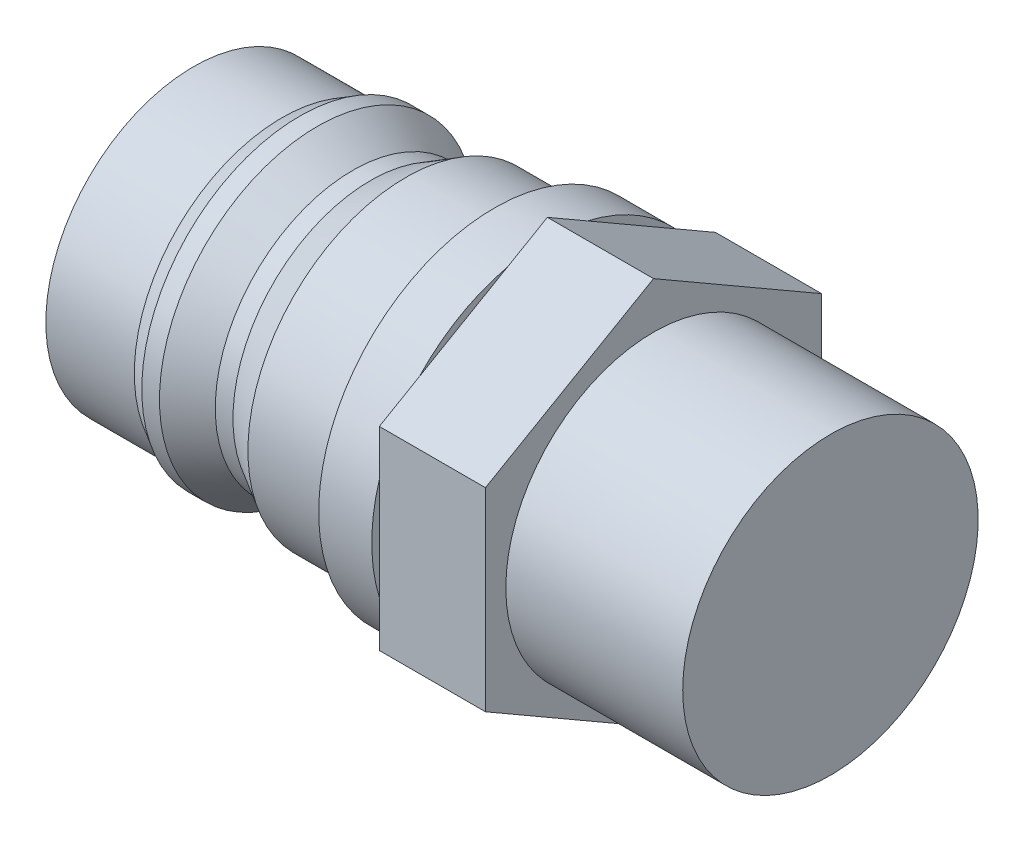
ISO-10303-21;
HEADER;
FILE_DESCRIPTION(('STEP AP214'),'2;1');
FILE_NAME('part.step','',(''),(''),'','','');
FILE_SCHEMA(('AUTOMOTIVE_DESIGN { 1 0 10303 214 1 1 1 1 }'));
ENDSEC;
DATA;
#1=APPLICATION_CONTEXT('core data for automotive mechanical design processes');
#2=APPLICATION_PROTOCOL_DEFINITION('international standard','automotive_design',2000,#1);
#3=PRODUCT_CONTEXT('',#1,'mechanical');
#4=PRODUCT('Part','Part','',(#3));
#5=PRODUCT_RELATED_PRODUCT_CATEGORY('part','',(#4));
#6=PRODUCT_DEFINITION_FORMATION('','',#4);
#7=PRODUCT_DEFINITION_CONTEXT('part definition',#1,'design');
#8=PRODUCT_DEFINITION('design','',#6,#7);
#9=PRODUCT_DEFINITION_SHAPE('','',#8);
#10=(LENGTH_UNIT() NAMED_UNIT(*) SI_UNIT(.MILLI.,.METRE.));
#11=(NAMED_UNIT(*) PLANE_ANGLE_UNIT() SI_UNIT($,.RADIAN.));
#12=(NAMED_UNIT(*) SI_UNIT($,.STERADIAN.) SOLID_ANGLE_UNIT());
#13=UNCERTAINTY_MEASURE_WITH_UNIT(LENGTH_MEASURE(1.E-05),#10,'distance_accuracy_value','');
#14=(GEOMETRIC_REPRESENTATION_CONTEXT(3) GLOBAL_UNCERTAINTY_ASSIGNED_CONTEXT((#13)) GLOBAL_UNIT_ASSIGNED_CONTEXT((#10,
#11,#12)) REPRESENTATION_CONTEXT('',''));
#15=CARTESIAN_POINT('',(0.,0.,0.));
#16=DIRECTION('',(0.,0.,1.));
#17=DIRECTION('',(1.,0.,0.));
#18=AXIS2_PLACEMENT_3D('',#15,#16,#17);
#19=CARTESIAN_POINT('',(20.,9.92735026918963,0.));
#20=DIRECTION('',(1.,0.,0.));
#21=DIRECTION('',(0.,0.,-1.));
#22=AXIS2_PLACEMENT_3D('',#19,#20,#21);
#23=PLANE('',#22);
#24=DIRECTION('',(0.,0.5,0.866025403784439));
#25=VECTOR('',#24,1.);
#26=CARTESIAN_POINT('',(20.,5.48482755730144,-9.5));
#27=LINE('',#26,#25);
#28=CARTESIAN_POINT('',(20.,6.78655717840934,-7.24533815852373));
#29=VERTEX_POINT('',#28);
#30=CARTESIAN_POINT('',(20.,9.66792549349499,-2.25466184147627));
#31=VERTEX_POINT('',#30);
#32=EDGE_CURVE('E11',#29,#31,#27,.T.);
#33=ORIENTED_EDGE('',*,*,#32,.F.);
#34=CARTESIAN_POINT('',(20.,0.,0.));
#35=DIRECTION('',(1.,0.,0.));
#36=DIRECTION('',(0.,0.,-1.));
#37=AXIS2_PLACEMENT_3D('',#34,#35,#36);
#38=CIRCLE('',#37,9.92735026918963);
#39=EDGE_CURVE('E162',#29,#31,#38,.T.);
#40=ORIENTED_EDGE('',*,*,#39,.T.);
#41=EDGE_LOOP('',(#33,#40));
#42=FACE_BOUND('',#41,.T.);
#43=ADVANCED_FACE('F33',(#42),#23,.T.);
#44=DIRECTION('',(0.,1.,0.));
#45=VECTOR('',#44,1.);
#46=CARTESIAN_POINT('',(20.,-5.48482755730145,-9.5));
#47=LINE('',#46,#45);
#48=CARTESIAN_POINT('',(20.,-2.88136831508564,-9.5));
#49=VERTEX_POINT('',#48);
#50=CARTESIAN_POINT('',(20.,2.88136831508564,-9.5));
#51=VERTEX_POINT('',#50);
#52=EDGE_CURVE('E42',#49,#51,#47,.T.);
#53=ORIENTED_EDGE('',*,*,#52,.F.);
#54=EDGE_CURVE('E152',#49,#51,#38,.T.);
#55=ORIENTED_EDGE('',*,*,#54,.T.);
#56=EDGE_LOOP('',(#53,#55));
#57=FACE_BOUND('',#56,.T.);
#58=ADVANCED_FACE('F228',(#57),#23,.T.);
#59=DIRECTION('',(0.,0.5,-0.866025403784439));
#60=VECTOR('',#59,1.);
#61=CARTESIAN_POINT('',(20.,-10.9696551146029,0.));
#62=LINE('',#61,#60);
#63=CARTESIAN_POINT('',(20.,-9.66792549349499,-2.25466184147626));
#64=VERTEX_POINT('',#63);
#65=CARTESIAN_POINT('',(20.,-6.78655717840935,-7.24533815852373));
#66=VERTEX_POINT('',#65);
#67=EDGE_CURVE('E292',#64,#66,#62,.T.);
#68=ORIENTED_EDGE('',*,*,#67,.F.);
#69=EDGE_CURVE('E316',#64,#66,#38,.T.);
#70=ORIENTED_EDGE('',*,*,#69,.T.);
#71=EDGE_LOOP('',(#68,#70));
#72=FACE_BOUND('',#71,.T.);
#73=ADVANCED_FACE('F235',(#72),#23,.T.);
#74=DIRECTION('',(0.,-0.5,-0.866025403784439));
#75=VECTOR('',#74,1.);
#76=CARTESIAN_POINT('',(20.,-5.48482755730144,9.5));
#77=LINE('',#76,#75);
#78=CARTESIAN_POINT('',(20.,-6.78655717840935,7.24533815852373));
#79=VERTEX_POINT('',#78);
#80=CARTESIAN_POINT('',(20.,-9.66792549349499,2.25466184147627));
#81=VERTEX_POINT('',#80);
#82=EDGE_CURVE('E196',#79,#81,#77,.T.);
#83=ORIENTED_EDGE('',*,*,#82,.F.);
#84=EDGE_CURVE('E311',#79,#81,#38,.T.);
#85=ORIENTED_EDGE('',*,*,#84,.T.);
#86=EDGE_LOOP('',(#83,#85));
#87=FACE_BOUND('',#86,.T.);
#88=ADVANCED_FACE('F254',(#87),#23,.T.);
#89=DIRECTION('',(0.,-1.,0.));
#90=VECTOR('',#89,1.);
#91=CARTESIAN_POINT('',(20.,5.48482755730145,9.5));
#92=LINE('',#91,#90);
#93=CARTESIAN_POINT('',(20.,2.88136831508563,9.5));
#94=VERTEX_POINT('',#93);
#95=CARTESIAN_POINT('',(20.,-2.88136831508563,9.5));
#96=VERTEX_POINT('',#95);
#97=EDGE_CURVE('E191',#94,#96,#92,.T.);
#98=ORIENTED_EDGE('',*,*,#97,.F.);
#99=EDGE_CURVE('E265',#94,#96,#38,.T.);
#100=ORIENTED_EDGE('',*,*,#99,.T.);
#101=EDGE_LOOP('',(#98,#100));
#102=FACE_BOUND('',#101,.T.);
#103=ADVANCED_FACE('F242',(#102),#23,.T.);
#104=CARTESIAN_POINT('',(0.,0.,0.));
#105=DIRECTION('',(-1.,0.,0.));
#106=DIRECTION('',(0.,0.,1.));
#107=AXIS2_PLACEMENT_3D('',#104,#105,#106);
#108=PLANE('',#107);
#109=CARTESIAN_POINT('',(0.,0.,0.));
#110=DIRECTION('',(1.,0.,0.));
#111=DIRECTION('',(0.,0.,-1.));
#112=AXIS2_PLACEMENT_3D('',#109,#110,#111);
#113=CIRCLE('',#112,8.35);
#114=CARTESIAN_POINT('',(0.,0.,-8.35));
#115=VERTEX_POINT('',#114);
#116=EDGE_CURVE('E37',#115,#115,#113,.T.);
#117=ORIENTED_EDGE('',*,*,#116,.F.);
#118=EDGE_LOOP('',(#117));
#119=FACE_BOUND('',#118,.T.);
#120=ADVANCED_FACE('F35',(#119),#108,.T.);
#121=CARTESIAN_POINT('',(20.,0.,0.));
#122=DIRECTION('',(1.,0.,0.));
#123=DIRECTION('',(0.,0.,-1.));
#124=AXIS2_PLACEMENT_3D('',#121,#122,#123);
#125=CYLINDRICAL_SURFACE('',#124,8.35);
#126=ORIENTED_EDGE('',*,*,#116,.T.);
#127=EDGE_LOOP('',(#126));
#128=FACE_BOUND('',#127,.T.);
#129=CARTESIAN_POINT('',(5.,0.,0.));
#130=DIRECTION('',(1.,0.,0.));
#131=DIRECTION('',(0.,0.,-1.));
#132=AXIS2_PLACEMENT_3D('',#129,#130,#131);
#133=CIRCLE('',#132,8.35);
#134=CARTESIAN_POINT('',(5.,0.,-8.35));
#135=VERTEX_POINT('',#134);
#136=EDGE_CURVE('E182',#135,#135,#133,.T.);
#137=ORIENTED_EDGE('',*,*,#136,.F.);
#138=EDGE_LOOP('',(#137));
#139=FACE_BOUND('',#138,.T.);
#140=ADVANCED_FACE('F260',(#128,#139),#125,.T.);
#141=CARTESIAN_POINT('',(6.,0.,0.));
#142=DIRECTION('',(1.,0.,0.));
#143=DIRECTION('',(0.,0.,-1.));
#144=AXIS2_PLACEMENT_3D('',#141,#142,#143);
#145=CONICAL_SURFACE('',#144,8.92735026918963,0.523598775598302);
#146=ORIENTED_EDGE('',*,*,#136,.T.);
#147=EDGE_LOOP('',(#146));
#148=FACE_BOUND('',#147,.T.);
#149=CARTESIAN_POINT('',(6.,0.,0.));
#150=DIRECTION('',(1.,0.,0.));
#151=DIRECTION('',(0.,0.,-1.));
#152=AXIS2_PLACEMENT_3D('',#149,#150,#151);
#153=CIRCLE('',#152,8.92735026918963);
#154=CARTESIAN_POINT('',(6.,0.,-8.92735026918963));
#155=VERTEX_POINT('',#154);
#156=EDGE_CURVE('E180',#155,#155,#153,.T.);
#157=ORIENTED_EDGE('',*,*,#156,.F.);
#158=EDGE_LOOP('',(#157));
#159=FACE_BOUND('',#158,.T.);
#160=ADVANCED_FACE('F525',(#148,#159),#145,.T.);
#161=CARTESIAN_POINT('',(20.,0.,0.));
#162=DIRECTION('',(1.,0.,0.));
#163=DIRECTION('',(0.,0.,-1.));
#164=AXIS2_PLACEMENT_3D('',#161,#162,#163);
#165=CYLINDRICAL_SURFACE('',#164,8.92735026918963);
#166=ORIENTED_EDGE('',*,*,#156,.T.);
#167=EDGE_LOOP('',(#166));
#168=FACE_BOUND('',#167,.T.);
#169=CARTESIAN_POINT('',(7.,0.,0.));
#170=DIRECTION('',(1.,0.,0.));
#171=DIRECTION('',(0.,0.,-1.));
#172=AXIS2_PLACEMENT_3D('',#169,#170,#171);
#173=CIRCLE('',#172,8.92735026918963);
#174=CARTESIAN_POINT('',(7.,0.,-8.92735026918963));
#175=VERTEX_POINT('',#174);
#176=EDGE_CURVE('E177',#175,#175,#173,.T.);
#177=ORIENTED_EDGE('',*,*,#176,.F.);
#178=EDGE_LOOP('',(#177));
#179=FACE_BOUND('',#178,.T.);
#180=ADVANCED_FACE('F514',(#168,#179),#165,.T.);
#181=CARTESIAN_POINT('',(8.99999999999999,0.,0.));
#182=DIRECTION('',(-1.,0.,0.));
#183=DIRECTION('',(0.,0.,1.));
#184=AXIS2_PLACEMENT_3D('',#181,#182,#183);
#185=CONICAL_SURFACE('',#184,7.77264973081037,0.5235987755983);
#186=ORIENTED_EDGE('',*,*,#176,.T.);
#187=EDGE_LOOP('',(#186));
#188=FACE_BOUND('',#187,.T.);
#189=CARTESIAN_POINT('',(8.99999999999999,0.,0.));
#190=DIRECTION('',(1.,0.,0.));
#191=DIRECTION('',(0.,0.,-1.));
#192=AXIS2_PLACEMENT_3D('',#189,#190,#191);
#193=CIRCLE('',#192,7.77264973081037);
#194=CARTESIAN_POINT('',(8.99999999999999,0.,-7.77264973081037));
#195=VERTEX_POINT('',#194);
#196=EDGE_CURVE('E174',#195,#195,#193,.T.);
#197=ORIENTED_EDGE('',*,*,#196,.F.);
#198=EDGE_LOOP('',(#197));
#199=FACE_BOUND('',#198,.T.);
#200=ADVANCED_FACE('F504',(#188,#199),#185,.T.);
#201=CARTESIAN_POINT('',(20.,0.,0.));
#202=DIRECTION('',(1.,0.,0.));
#203=DIRECTION('',(0.,0.,-1.));
#204=AXIS2_PLACEMENT_3D('',#201,#202,#203);
#205=CYLINDRICAL_SURFACE('',#204,7.77264973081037);
#206=ORIENTED_EDGE('',*,*,#196,.T.);
#207=EDGE_LOOP('',(#206));
#208=FACE_BOUND('',#207,.T.);
#209=CARTESIAN_POINT('',(9.99999999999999,0.,0.));
#210=DIRECTION('',(1.,0.,0.));
#211=DIRECTION('',(0.,0.,-1.));
#212=AXIS2_PLACEMENT_3D('',#209,#210,#211);
#213=CIRCLE('',#212,7.77264973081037);
#214=CARTESIAN_POINT('',(9.99999999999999,0.,-7.77264973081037));
#215=VERTEX_POINT('',#214);
#216=EDGE_CURVE('E171',#215,#215,#213,.T.);
#217=ORIENTED_EDGE('',*,*,#216,.F.);
#218=EDGE_LOOP('',(#217));
#219=FACE_BOUND('',#218,.T.);
#220=ADVANCED_FACE('F492',(#208,#219),#205,.T.);
#221=CARTESIAN_POINT('',(12.,0.,0.));
#222=DIRECTION('',(1.,0.,0.));
#223=DIRECTION('',(0.,0.,-1.));
#224=AXIS2_PLACEMENT_3D('',#221,#222,#223);
#225=CONICAL_SURFACE('',#224,8.92735026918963,0.523598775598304);
#226=ORIENTED_EDGE('',*,*,#216,.T.);
#227=EDGE_LOOP('',(#226));
#228=FACE_BOUND('',#227,.T.);
#229=CARTESIAN_POINT('',(12.,0.,0.));
#230=DIRECTION('',(1.,0.,0.));
#231=DIRECTION('',(0.,0.,-1.));
#232=AXIS2_PLACEMENT_3D('',#229,#230,#231);
#233=CIRCLE('',#232,8.92735026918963);
#234=CARTESIAN_POINT('',(12.,0.,-8.92735026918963));
#235=VERTEX_POINT('',#234);
#236=EDGE_CURVE('E168',#235,#235,#233,.T.);
#237=ORIENTED_EDGE('',*,*,#236,.F.);
#238=EDGE_LOOP('',(#237));
#239=FACE_BOUND('',#238,.T.);
#240=ADVANCED_FACE('F483',(#228,#239),#225,.T.);
#241=CARTESIAN_POINT('',(20.,0.,0.));
#242=DIRECTION('',(1.,0.,0.));
#243=DIRECTION('',(0.,0.,-1.));
#244=AXIS2_PLACEMENT_3D('',#241,#242,#243);
#245=CYLINDRICAL_SURFACE('',#244,8.92735026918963);
#246=ORIENTED_EDGE('',*,*,#236,.T.);
#247=EDGE_LOOP('',(#246));
#248=FACE_BOUND('',#247,.T.);
#249=CARTESIAN_POINT('',(17.,0.,0.));
#250=DIRECTION('',(1.,0.,0.));
#251=DIRECTION('',(0.,0.,-1.));
#252=AXIS2_PLACEMENT_3D('',#249,#250,#251);
#253=CIRCLE('',#252,8.92735026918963);
#254=CARTESIAN_POINT('',(17.,0.,-8.92735026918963));
#255=VERTEX_POINT('',#254);
#256=EDGE_CURVE('E165',#255,#255,#253,.T.);
#257=ORIENTED_EDGE('',*,*,#256,.F.);
#258=EDGE_LOOP('',(#257));
#259=FACE_BOUND('',#258,.T.);
#260=ADVANCED_FACE('F474',(#248,#259),#245,.T.);
#261=CARTESIAN_POINT('',(17.,8.92735026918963,0.));
#262=DIRECTION('',(-1.,0.,0.));
#263=DIRECTION('',(0.,0.,1.));
#264=AXIS2_PLACEMENT_3D('',#261,#262,#263);
#265=PLANE('',#264);
#266=ORIENTED_EDGE('',*,*,#256,.T.);
#267=EDGE_LOOP('',(#266));
#268=FACE_BOUND('',#267,.T.);
#269=CARTESIAN_POINT('',(17.,0.,0.));
#270=DIRECTION('',(1.,0.,0.));
#271=DIRECTION('',(0.,0.,-1.));
#272=AXIS2_PLACEMENT_3D('',#269,#270,#271);
#273=CIRCLE('',#272,9.92735026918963);
#274=CARTESIAN_POINT('',(17.,0.,-9.92735026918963));
#275=VERTEX_POINT('',#274);
#276=EDGE_CURVE('E161',#275,#275,#273,.T.);
#277=ORIENTED_EDGE('',*,*,#276,.F.);
#278=EDGE_LOOP('',(#277));
#279=FACE_BOUND('',#278,.T.);
#280=ADVANCED_FACE('F251',(#268,#279),#265,.T.);
#281=CARTESIAN_POINT('',(20.,0.,0.));
#282=DIRECTION('',(1.,0.,0.));
#283=DIRECTION('',(0.,0.,-1.));
#284=AXIS2_PLACEMENT_3D('',#281,#282,#283);
#285=CYLINDRICAL_SURFACE('',#284,9.92735026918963);
#286=ORIENTED_EDGE('',*,*,#276,.T.);
#287=EDGE_LOOP('',(#286));
#288=FACE_BOUND('',#287,.T.);
#289=EDGE_CURVE('E155',#51,#29,#38,.T.);
#290=ORIENTED_EDGE('',*,*,#289,.F.);
#291=ORIENTED_EDGE('',*,*,#54,.F.);
#292=EDGE_CURVE('E57',#66,#49,#38,.T.);
#293=ORIENTED_EDGE('',*,*,#292,.F.);
#294=ORIENTED_EDGE('',*,*,#69,.F.);
#295=EDGE_CURVE('E313',#81,#64,#38,.T.);
#296=ORIENTED_EDGE('',*,*,#295,.F.);
#297=ORIENTED_EDGE('',*,*,#84,.F.);
#298=EDGE_CURVE('E276',#96,#79,#38,.T.);
#299=ORIENTED_EDGE('',*,*,#298,.F.);
#300=ORIENTED_EDGE('',*,*,#99,.F.);
#301=CARTESIAN_POINT('',(20.,6.78655717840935,7.24533815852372));
#302=VERTEX_POINT('',#301);
#303=EDGE_CURVE('E273',#302,#94,#38,.T.);
#304=ORIENTED_EDGE('',*,*,#303,.F.);
#305=CARTESIAN_POINT('',(20.,9.66792549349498,2.25466184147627));
#306=VERTEX_POINT('',#305);
#307=EDGE_CURVE('E280',#306,#302,#38,.T.);
#308=ORIENTED_EDGE('',*,*,#307,.F.);
#309=EDGE_CURVE('E579',#31,#306,#38,.T.);
#310=ORIENTED_EDGE('',*,*,#309,.F.);
#311=ORIENTED_EDGE('',*,*,#39,.F.);
#312=EDGE_LOOP('',(#290,#291,#293,#294,#296,#297,#299,#300,#304,#308,#310,#311));
#313=FACE_BOUND('',#312,.T.);
#314=ADVANCED_FACE('F240',(#288,#313),#285,.T.);
#315=DIRECTION('',(0.,-0.5,0.866025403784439));
#316=VECTOR('',#315,1.);
#317=CARTESIAN_POINT('',(20.,10.9696551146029,0.));
#318=LINE('',#317,#316);
#319=EDGE_CURVE('E187',#306,#302,#318,.T.);
#320=ORIENTED_EDGE('',*,*,#319,.F.);
#321=ORIENTED_EDGE('',*,*,#307,.T.);
#322=EDGE_LOOP('',(#320,#321));
#323=FACE_BOUND('',#322,.T.);
#324=ADVANCED_FACE('F231',(#323),#23,.T.);
#325=CARTESIAN_POINT('',(20.,0.,0.));
#326=DIRECTION('',(1.,0.,0.));
#327=DIRECTION('',(0.,0.,-1.));
#328=AXIS2_PLACEMENT_3D('',#325,#326,#327);
#329=PLANE('',#328);
#330=CARTESIAN_POINT('',(20.,5.48482755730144,-9.5));
#331=VERTEX_POINT('',#330);
#332=EDGE_CURVE('E291',#51,#331,#47,.T.);
#333=ORIENTED_EDGE('',*,*,#332,.F.);
#334=ORIENTED_EDGE('',*,*,#289,.T.);
#335=EDGE_CURVE('E44',#331,#29,#27,.T.);
#336=ORIENTED_EDGE('',*,*,#335,.F.);
#337=EDGE_LOOP('',(#333,#334,#336));
#338=FACE_BOUND('',#337,.T.);
#339=ADVANCED_FACE('F239',(#338),#329,.F.);
#340=CARTESIAN_POINT('',(20.,10.9696551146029,0.));
#341=VERTEX_POINT('',#340);
#342=EDGE_CURVE('E45',#31,#341,#27,.T.);
#343=ORIENTED_EDGE('',*,*,#342,.F.);
#344=ORIENTED_EDGE('',*,*,#309,.T.);
#345=EDGE_CURVE('E193',#341,#306,#318,.T.);
#346=ORIENTED_EDGE('',*,*,#345,.F.);
#347=EDGE_LOOP('',(#343,#344,#346));
#348=FACE_BOUND('',#347,.T.);
#349=ADVANCED_FACE('F247',(#348),#329,.F.);
#350=CARTESIAN_POINT('',(20.,5.48482755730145,9.5));
#351=VERTEX_POINT('',#350);
#352=EDGE_CURVE('E194',#302,#351,#318,.T.);
#353=ORIENTED_EDGE('',*,*,#352,.F.);
#354=ORIENTED_EDGE('',*,*,#303,.T.);
#355=EDGE_CURVE('E198',#351,#94,#92,.T.);
#356=ORIENTED_EDGE('',*,*,#355,.F.);
#357=EDGE_LOOP('',(#353,#354,#356));
#358=FACE_BOUND('',#357,.T.);
#359=ADVANCED_FACE('F279',(#358),#329,.F.);
#360=CARTESIAN_POINT('',(20.,-5.48482755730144,9.5));
#361=VERTEX_POINT('',#360);
#362=EDGE_CURVE('E199',#96,#361,#92,.T.);
#363=ORIENTED_EDGE('',*,*,#362,.F.);
#364=ORIENTED_EDGE('',*,*,#298,.T.);
#365=EDGE_CURVE('E283',#361,#79,#77,.T.);
#366=ORIENTED_EDGE('',*,*,#365,.F.);
#367=EDGE_LOOP('',(#363,#364,#366));
#368=FACE_BOUND('',#367,.T.);
#369=ADVANCED_FACE('F310',(#368),#329,.F.);
#370=CARTESIAN_POINT('',(20.,-10.9696551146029,0.));
#371=VERTEX_POINT('',#370);
#372=EDGE_CURVE('E282',#81,#371,#77,.T.);
#373=ORIENTED_EDGE('',*,*,#372,.F.);
#374=ORIENTED_EDGE('',*,*,#295,.T.);
#375=EDGE_CURVE('E288',#371,#64,#62,.T.);
#376=ORIENTED_EDGE('',*,*,#375,.F.);
#377=EDGE_LOOP('',(#373,#374,#376));
#378=FACE_BOUND('',#377,.T.);
#379=ADVANCED_FACE('F330',(#378),#329,.F.);
#380=CARTESIAN_POINT('',(20.,-5.48482755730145,-9.5));
#381=VERTEX_POINT('',#380);
#382=EDGE_CURVE('E287',#66,#381,#62,.T.);
#383=ORIENTED_EDGE('',*,*,#382,.F.);
#384=ORIENTED_EDGE('',*,*,#292,.T.);
#385=EDGE_CURVE('E146',#381,#49,#47,.T.);
#386=ORIENTED_EDGE('',*,*,#385,.F.);
#387=EDGE_LOOP('',(#383,#384,#386));
#388=FACE_BOUND('',#387,.T.);
#389=ADVANCED_FACE('F250',(#388),#329,.F.);
#390=CARTESIAN_POINT('',(26.,5.48482755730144,-9.5));
#391=DIRECTION('',(0.,-0.866025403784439,0.5));
#392=DIRECTION('',(0.,-0.5,-0.866025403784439));
#393=AXIS2_PLACEMENT_3D('',#390,#391,#392);
#394=PLANE('',#393);
#395=ORIENTED_EDGE('',*,*,#335,.T.);
#396=ORIENTED_EDGE('',*,*,#32,.T.);
#397=ORIENTED_EDGE('',*,*,#342,.T.);
#398=DIRECTION('',(-1.,0.,0.));
#399=VECTOR('',#398,1.);
#400=CARTESIAN_POINT('',(26.,10.9696551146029,0.));
#401=LINE('',#400,#399);
#402=CARTESIAN_POINT('',(26.,10.9696551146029,0.));
#403=VERTEX_POINT('',#402);
#404=EDGE_CURVE('E131',#403,#341,#401,.T.);
#405=ORIENTED_EDGE('',*,*,#404,.F.);
#406=DIRECTION('',(0.,0.5,0.866025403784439));
#407=VECTOR('',#406,1.);
#408=CARTESIAN_POINT('',(26.,5.48482755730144,-9.5));
#409=LINE('',#408,#407);
#410=CARTESIAN_POINT('',(26.,5.48482755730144,-9.5));
#411=VERTEX_POINT('',#410);
#412=EDGE_CURVE('E137',#411,#403,#409,.T.);
#413=ORIENTED_EDGE('',*,*,#412,.F.);
#414=DIRECTION('',(-1.,0.,0.));
#415=VECTOR('',#414,1.);
#416=CARTESIAN_POINT('',(26.,5.48482755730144,-9.5));
#417=LINE('',#416,#415);
#418=EDGE_CURVE('E205',#411,#331,#417,.T.);
#419=ORIENTED_EDGE('',*,*,#418,.T.);
#420=EDGE_LOOP('',(#395,#396,#397,#405,#413,#419));
#421=FACE_BOUND('',#420,.T.);
#422=ADVANCED_FACE('F149',(#421),#394,.F.);
#423=CARTESIAN_POINT('',(26.,10.9696551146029,0.));
#424=DIRECTION('',(0.,-0.866025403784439,-0.5));
#425=DIRECTION('',(0.,0.5,-0.866025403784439));
#426=AXIS2_PLACEMENT_3D('',#423,#424,#425);
#427=PLANE('',#426);
#428=ORIENTED_EDGE('',*,*,#345,.T.);
#429=ORIENTED_EDGE('',*,*,#319,.T.);
#430=ORIENTED_EDGE('',*,*,#352,.T.);
#431=DIRECTION('',(-1.,0.,0.));
#432=VECTOR('',#431,1.);
#433=CARTESIAN_POINT('',(26.,5.48482755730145,9.5));
#434=LINE('',#433,#432);
#435=CARTESIAN_POINT('',(26.,5.48482755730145,9.5));
#436=VERTEX_POINT('',#435);
#437=EDGE_CURVE('E133',#436,#351,#434,.T.);
#438=ORIENTED_EDGE('',*,*,#437,.F.);
#439=DIRECTION('',(0.,-0.5,0.866025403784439));
#440=VECTOR('',#439,1.);
#441=CARTESIAN_POINT('',(26.,10.9696551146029,0.));
#442=LINE('',#441,#440);
#443=EDGE_CURVE('E126',#403,#436,#442,.T.);
#444=ORIENTED_EDGE('',*,*,#443,.F.);
#445=ORIENTED_EDGE('',*,*,#404,.T.);
#446=EDGE_LOOP('',(#428,#429,#430,#438,#444,#445));
#447=FACE_BOUND('',#446,.T.);
#448=ADVANCED_FACE('F129',(#447),#427,.F.);
#449=CARTESIAN_POINT('',(26.,5.48482755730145,9.5));
#450=DIRECTION('',(0.,0.,-1.));
#451=DIRECTION('',(0.,1.,0.));
#452=AXIS2_PLACEMENT_3D('',#449,#450,#451);
#453=PLANE('',#452);
#454=ORIENTED_EDGE('',*,*,#355,.T.);
#455=ORIENTED_EDGE('',*,*,#97,.T.);
#456=ORIENTED_EDGE('',*,*,#362,.T.);
#457=DIRECTION('',(-1.,0.,0.));
#458=VECTOR('',#457,1.);
#459=CARTESIAN_POINT('',(26.,-5.48482755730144,9.5));
#460=LINE('',#459,#458);
#461=CARTESIAN_POINT('',(26.,-5.48482755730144,9.5));
#462=VERTEX_POINT('',#461);
#463=EDGE_CURVE('E156',#462,#361,#460,.T.);
#464=ORIENTED_EDGE('',*,*,#463,.F.);
#465=DIRECTION('',(0.,-1.,0.));
#466=VECTOR('',#465,1.);
#467=CARTESIAN_POINT('',(26.,5.48482755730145,9.5));
#468=LINE('',#467,#466);
#469=EDGE_CURVE('E136',#436,#462,#468,.T.);
#470=ORIENTED_EDGE('',*,*,#469,.F.);
#471=ORIENTED_EDGE('',*,*,#437,.T.);
#472=EDGE_LOOP('',(#454,#455,#456,#464,#470,#471));
#473=FACE_BOUND('',#472,.T.);
#474=ADVANCED_FACE('F281',(#473),#453,.F.);
#475=CARTESIAN_POINT('',(26.,-5.48482755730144,9.5));
#476=DIRECTION('',(0.,0.866025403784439,-0.5));
#477=DIRECTION('',(0.,0.5,0.866025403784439));
#478=AXIS2_PLACEMENT_3D('',#475,#476,#477);
#479=PLANE('',#478);
#480=ORIENTED_EDGE('',*,*,#365,.T.);
#481=ORIENTED_EDGE('',*,*,#82,.T.);
#482=ORIENTED_EDGE('',*,*,#372,.T.);
#483=DIRECTION('',(-1.,0.,0.));
#484=VECTOR('',#483,1.);
#485=CARTESIAN_POINT('',(26.,-10.9696551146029,0.));
#486=LINE('',#485,#484);
#487=CARTESIAN_POINT('',(26.,-10.9696551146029,0.));
#488=VERTEX_POINT('',#487);
#489=EDGE_CURVE('E299',#488,#371,#486,.T.);
#490=ORIENTED_EDGE('',*,*,#489,.F.);
#491=DIRECTION('',(0.,-0.5,-0.866025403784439));
#492=VECTOR('',#491,1.);
#493=CARTESIAN_POINT('',(26.,-5.48482755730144,9.5));
#494=LINE('',#493,#492);
#495=EDGE_CURVE('E208',#462,#488,#494,.T.);
#496=ORIENTED_EDGE('',*,*,#495,.F.);
#497=ORIENTED_EDGE('',*,*,#463,.T.);
#498=EDGE_LOOP('',(#480,#481,#482,#490,#496,#497));
#499=FACE_BOUND('',#498,.T.);
#500=ADVANCED_FACE('F306',(#499),#479,.F.);
#501=CARTESIAN_POINT('',(26.,-10.9696551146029,0.));
#502=DIRECTION('',(0.,0.866025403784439,0.5));
#503=DIRECTION('',(0.,-0.5,0.866025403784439));
#504=AXIS2_PLACEMENT_3D('',#501,#502,#503);
#505=PLANE('',#504);
#506=ORIENTED_EDGE('',*,*,#375,.T.);
#507=ORIENTED_EDGE('',*,*,#67,.T.);
#508=ORIENTED_EDGE('',*,*,#382,.T.);
#509=DIRECTION('',(-1.,0.,0.));
#510=VECTOR('',#509,1.);
#511=CARTESIAN_POINT('',(26.,-5.48482755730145,-9.5));
#512=LINE('',#511,#510);
#513=CARTESIAN_POINT('',(26.,-5.48482755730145,-9.5));
#514=VERTEX_POINT('',#513);
#515=EDGE_CURVE('E296',#514,#381,#512,.T.);
#516=ORIENTED_EDGE('',*,*,#515,.F.);
#517=DIRECTION('',(0.,0.5,-0.866025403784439));
#518=VECTOR('',#517,1.);
#519=CARTESIAN_POINT('',(26.,-10.9696551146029,0.));
#520=LINE('',#519,#518);
#521=EDGE_CURVE('E206',#488,#514,#520,.T.);
#522=ORIENTED_EDGE('',*,*,#521,.F.);
#523=ORIENTED_EDGE('',*,*,#489,.T.);
#524=EDGE_LOOP('',(#506,#507,#508,#516,#522,#523));
#525=FACE_BOUND('',#524,.T.);
#526=ADVANCED_FACE('F329',(#525),#505,.F.);
#527=CARTESIAN_POINT('',(26.,-5.48482755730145,-9.5));
#528=DIRECTION('',(0.,0.,1.));
#529=DIRECTION('',(1.,0.,0.));
#530=AXIS2_PLACEMENT_3D('',#527,#528,#529);
#531=PLANE('',#530);
#532=ORIENTED_EDGE('',*,*,#385,.T.);
#533=ORIENTED_EDGE('',*,*,#52,.T.);
#534=ORIENTED_EDGE('',*,*,#332,.T.);
#535=ORIENTED_EDGE('',*,*,#418,.F.);
#536=DIRECTION('',(0.,1.,0.));
#537=VECTOR('',#536,1.);
#538=CARTESIAN_POINT('',(26.,-5.48482755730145,-9.5));
#539=LINE('',#538,#537);
#540=EDGE_CURVE('E142',#514,#411,#539,.T.);
#541=ORIENTED_EDGE('',*,*,#540,.F.);
#542=ORIENTED_EDGE('',*,*,#515,.T.);
#543=EDGE_LOOP('',(#532,#533,#534,#535,#541,#542));
#544=FACE_BOUND('',#543,.T.);
#545=ADVANCED_FACE('F325',(#544),#531,.F.);
#546=CARTESIAN_POINT('',(26.,0.,0.));
#547=DIRECTION('',(1.,0.,0.));
#548=DIRECTION('',(0.,0.,-1.));
#549=AXIS2_PLACEMENT_3D('',#546,#547,#548);
#550=PLANE('',#549);
#551=CARTESIAN_POINT('',(26.,0.,0.));
#552=DIRECTION('',(-1.,0.,0.));
#553=DIRECTION('',(0.,0.,1.));
#554=AXIS2_PLACEMENT_3D('',#551,#552,#553);
#555=CIRCLE('',#554,8.35);
#556=CARTESIAN_POINT('',(26.,0.,8.35));
#557=VERTEX_POINT('',#556);
#558=EDGE_CURVE('E202',#557,#557,#555,.T.);
#559=ORIENTED_EDGE('',*,*,#558,.T.);
#560=EDGE_LOOP('',(#559));
#561=FACE_BOUND('',#560,.T.);
#562=ORIENTED_EDGE('',*,*,#412,.T.);
#563=ORIENTED_EDGE('',*,*,#443,.T.);
#564=ORIENTED_EDGE('',*,*,#469,.T.);
#565=ORIENTED_EDGE('',*,*,#495,.T.);
#566=ORIENTED_EDGE('',*,*,#521,.T.);
#567=ORIENTED_EDGE('',*,*,#540,.T.);
#568=EDGE_LOOP('',(#562,#563,#564,#565,#566,#567));
#569=FACE_BOUND('',#568,.T.);
#570=ADVANCED_FACE('F140',(#561,#569),#550,.T.);
#571=CARTESIAN_POINT('',(26.,0.,0.));
#572=DIRECTION('',(-1.,0.,0.));
#573=DIRECTION('',(0.,0.,1.));
#574=AXIS2_PLACEMENT_3D('',#571,#572,#573);
#575=CYLINDRICAL_SURFACE('',#574,8.35);
#576=ORIENTED_EDGE('',*,*,#558,.F.);
#577=EDGE_LOOP('',(#576));
#578=FACE_BOUND('',#577,.T.);
#579=CARTESIAN_POINT('',(36.,0.,0.));
#580=DIRECTION('',(-1.,0.,0.));
#581=DIRECTION('',(0.,0.,1.));
#582=AXIS2_PLACEMENT_3D('',#579,#580,#581);
#583=CIRCLE('',#582,8.35);
#584=CARTESIAN_POINT('',(36.,0.,8.35));
#585=VERTEX_POINT('',#584);
#586=EDGE_CURVE('E213',#585,#585,#583,.T.);
#587=ORIENTED_EDGE('',*,*,#586,.T.);
#588=EDGE_LOOP('',(#587));
#589=FACE_BOUND('',#588,.T.);
#590=ADVANCED_FACE('F217',(#578,#589),#575,.T.);
#591=CARTESIAN_POINT('',(36.,8.35,0.));
#592=DIRECTION('',(-1.,0.,0.));
#593=DIRECTION('',(0.,0.,1.));
#594=AXIS2_PLACEMENT_3D('',#591,#592,#593);
#595=PLANE('',#594);
#596=ORIENTED_EDGE('',*,*,#586,.F.);
#597=EDGE_LOOP('',(#596));
#598=FACE_BOUND('',#597,.T.);
#599=ADVANCED_FACE('F219',(#598),#595,.F.);
#600=CLOSED_SHELL('',(#43,#58,#73,#88,#103,#120,#140,#160,#180,#200,#220,#240,#260,#280,#314,
#324,#339,#349,#359,#369,#379,#389,#422,#448,#474,#500,#526,#545,#570,#590,#599));
#601=MANIFOLD_SOLID_BREP('B2',#600);
#602=ADVANCED_BREP_SHAPE_REPRESENTATION('',(#18,#601),#14);
#603=SHAPE_DEFINITION_REPRESENTATION(#9,#602);
ENDSEC;
END-ISO-10303-21;
